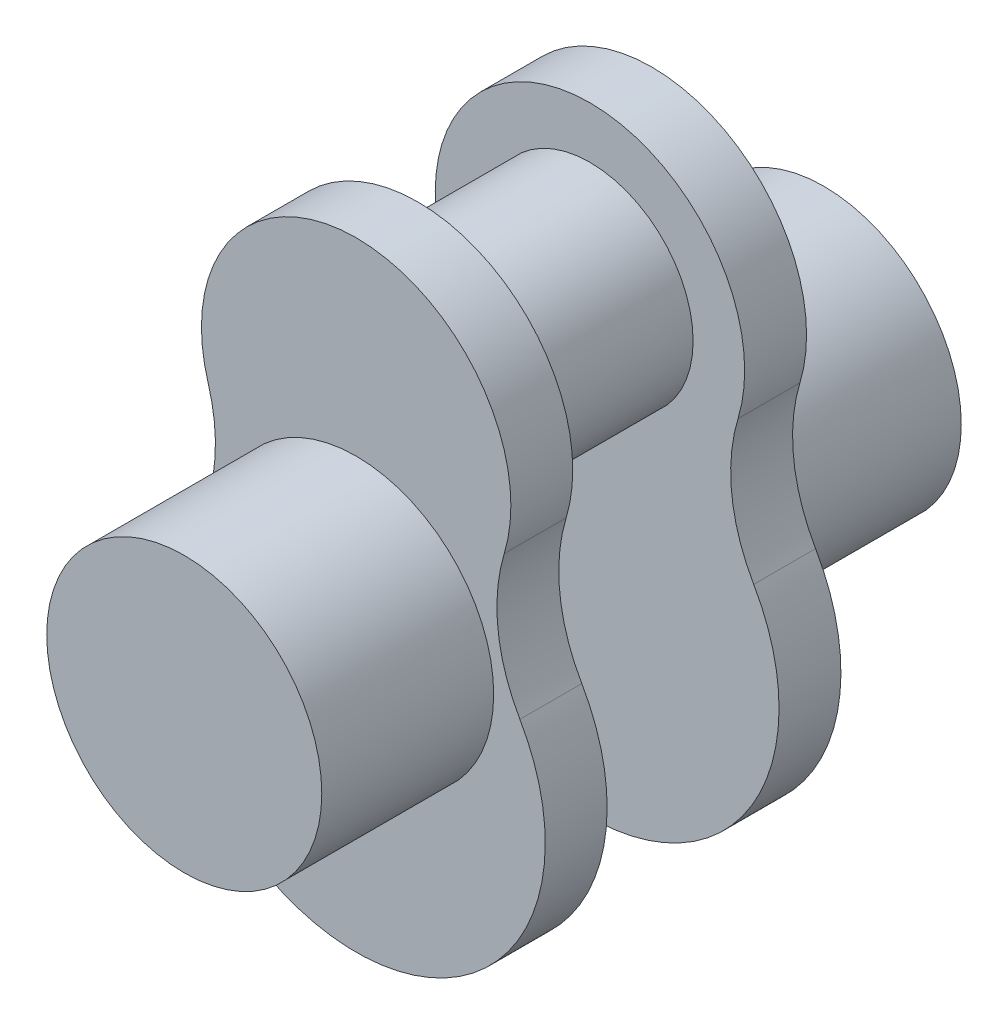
from build123d import *

# Parameters (mm, degrees)
SZKIC1_R            = 30
WYCI_GNI_CIE1_DEPTH = 25
WYCI_GNI_CIE2_DEPTH = 18
SZKIC3_R            = 40
WYCI_GNI_CIE3_DEPTH = 50


with BuildPart() as part:
    # Szkic1 → Wyci_gni_cie1 (new, symmetric)
    with BuildSketch(Plane.XY):
        with Locations((0, 50)):
            Circle(SZKIC1_R)
    extrude(amount=WYCI_GNI_CIE1_DEPTH, both=True)

    # Szkic2 → Wyci_gni_cie2 (add)
    with BuildSketch(Plane.XY.offset(25)):
        with BuildLine():
            ThreePointArc((43.073368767, 36.973684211), (0, 95), (-43.073368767, 36.973684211))
            ThreePointArc((-43.073368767, 36.973684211), (-41.262704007, 16.764606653), (-47.631397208, -2.5))
            ThreePointArc((-47.631397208, -2.5), (0, -85), (47.631397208, -2.5))
            ThreePointArc((47.631397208, -2.5), (41.262704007, 16.764606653), (43.073368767, 36.973684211))
        make_face()
    wyci_gni_cie2 = extrude(amount=WYCI_GNI_CIE2_DEPTH)

    # Szkic3 → Wyci_gni_cie3 (add)
    with BuildSketch(Plane.XY.offset(43)):
        with Locations(Location((0, 0, 0), (0, 0, 180))):
            Circle(SZKIC3_R)
    wyci_gni_cie3 = extrude(amount=WYCI_GNI_CIE3_DEPTH)

    # Lustro1: Wyci_gni_cie2, Wyci_gni_cie3 across plane
    add(wyci_gni_cie2.mirror(Plane.XY))
    add(wyci_gni_cie3.mirror(Plane.XY))


solid = part.part
